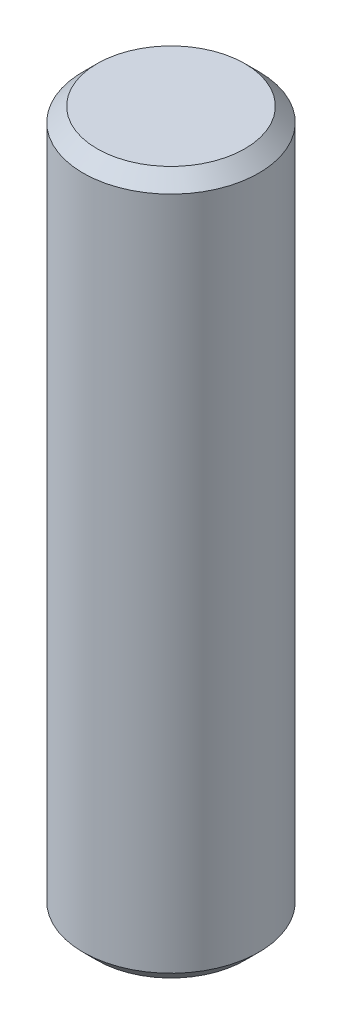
ISO-10303-21;
HEADER;
FILE_DESCRIPTION(('STEP AP214'),'2;1');
FILE_NAME('part.step','',(''),(''),'','','');
FILE_SCHEMA(('AUTOMOTIVE_DESIGN { 1 0 10303 214 1 1 1 1 }'));
ENDSEC;
DATA;
#1=APPLICATION_CONTEXT('core data for automotive mechanical design processes');
#2=APPLICATION_PROTOCOL_DEFINITION('international standard','automotive_design',2000,#1);
#3=PRODUCT_CONTEXT('',#1,'mechanical');
#4=PRODUCT('Part','Part','',(#3));
#5=PRODUCT_RELATED_PRODUCT_CATEGORY('part','',(#4));
#6=PRODUCT_DEFINITION_FORMATION('','',#4);
#7=PRODUCT_DEFINITION_CONTEXT('part definition',#1,'design');
#8=PRODUCT_DEFINITION('design','',#6,#7);
#9=PRODUCT_DEFINITION_SHAPE('','',#8);
#10=(LENGTH_UNIT() NAMED_UNIT(*) SI_UNIT(.MILLI.,.METRE.));
#11=(NAMED_UNIT(*) PLANE_ANGLE_UNIT() SI_UNIT($,.RADIAN.));
#12=(NAMED_UNIT(*) SI_UNIT($,.STERADIAN.) SOLID_ANGLE_UNIT());
#13=UNCERTAINTY_MEASURE_WITH_UNIT(LENGTH_MEASURE(1.E-05),#10,'distance_accuracy_value','');
#14=(GEOMETRIC_REPRESENTATION_CONTEXT(3) GLOBAL_UNCERTAINTY_ASSIGNED_CONTEXT((#13)) GLOBAL_UNIT_ASSIGNED_CONTEXT((#10,
#11,#12)) REPRESENTATION_CONTEXT('',''));
#15=CARTESIAN_POINT('',(0.,0.,0.));
#16=DIRECTION('',(0.,0.,1.));
#17=DIRECTION('',(1.,0.,0.));
#18=AXIS2_PLACEMENT_3D('',#15,#16,#17);
#19=CARTESIAN_POINT('',(0.,38.1,0.));
#20=DIRECTION('',(0.,-1.,0.));
#21=DIRECTION('',(0.,0.,-1.));
#22=AXIS2_PLACEMENT_3D('',#19,#20,#21);
#23=CYLINDRICAL_SURFACE('',#22,9.52754);
#24=CARTESIAN_POINT('',(0.,-36.5759999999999,0.));
#25=DIRECTION('',(0.,1.,0.));
#26=DIRECTION('',(0.,0.,1.));
#27=AXIS2_PLACEMENT_3D('',#24,#25,#26);
#28=CIRCLE('',#27,9.52754);
#29=CARTESIAN_POINT('',(0.,-36.576,-9.52754));
#30=VERTEX_POINT('',#29);
#31=EDGE_CURVE('E40',#30,#30,#28,.T.);
#32=CARTESIAN_POINT('',(0.,36.576,0.));
#33=DIRECTION('',(0.,1.,0.));
#34=DIRECTION('',(0.,0.,1.));
#35=AXIS2_PLACEMENT_3D('',#32,#33,#34);
#36=CIRCLE('',#35,9.52754);
#37=CARTESIAN_POINT('',(0.,36.576,-9.52754));
#38=VERTEX_POINT('',#37);
#39=EDGE_CURVE('E44',#38,#38,#36,.F.);
#40=CARTESIAN_POINT('',(0.,-36.576,-9.52754));
#41=CARTESIAN_POINT('',(0.,-35.814,-9.52754));
#42=CARTESIAN_POINT('',(0.,-35.0519999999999,-9.52754));
#43=CARTESIAN_POINT('',(0.,-33.528,-9.52754));
#44=CARTESIAN_POINT('',(0.,-32.766,-9.52754));
#45=CARTESIAN_POINT('',(0.,-31.242,-9.52754));
#46=CARTESIAN_POINT('',(0.,-30.4799999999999,-9.52754));
#47=CARTESIAN_POINT('',(0.,-28.9559999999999,-9.52754));
#48=CARTESIAN_POINT('',(0.,-28.1939999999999,-9.52754));
#49=CARTESIAN_POINT('',(0.,-26.67,-9.52754));
#50=CARTESIAN_POINT('',(0.,-25.908,-9.52754));
#51=CARTESIAN_POINT('',(0.,-24.384,-9.52754));
#52=CARTESIAN_POINT('',(0.,-23.622,-9.52754));
#53=CARTESIAN_POINT('',(0.,-22.098,-9.52754));
#54=CARTESIAN_POINT('',(0.,-21.336,-9.52754));
#55=CARTESIAN_POINT('',(0.,-19.812,-9.52754));
#56=CARTESIAN_POINT('',(0.,-19.05,-9.52754));
#57=CARTESIAN_POINT('',(0.,-17.526,-9.52754));
#58=CARTESIAN_POINT('',(0.,-16.764,-9.52754));
#59=CARTESIAN_POINT('',(0.,-15.24,-9.52754));
#60=CARTESIAN_POINT('',(0.,-14.478,-9.52754));
#61=CARTESIAN_POINT('',(0.,-12.954,-9.52754));
#62=CARTESIAN_POINT('',(0.,-12.192,-9.52754));
#63=CARTESIAN_POINT('',(0.,-10.668,-9.52754));
#64=CARTESIAN_POINT('',(0.,-9.90599999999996,-9.52754));
#65=CARTESIAN_POINT('',(0.,-8.38199999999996,-9.52754));
#66=CARTESIAN_POINT('',(0.,-7.61999999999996,-9.52754));
#67=CARTESIAN_POINT('',(0.,-6.09599999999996,-9.52754));
#68=CARTESIAN_POINT('',(0.,-5.33399999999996,-9.52754));
#69=CARTESIAN_POINT('',(0.,-3.80999999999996,-9.52754));
#70=CARTESIAN_POINT('',(0.,-3.04799999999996,-9.52754));
#71=CARTESIAN_POINT('',(0.,-1.52399999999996,-9.52754));
#72=CARTESIAN_POINT('',(0.,-0.761999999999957,-9.52754));
#73=CARTESIAN_POINT('',(0.,0.76200000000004,-9.52754));
#74=CARTESIAN_POINT('',(0.,1.52400000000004,-9.52754));
#75=CARTESIAN_POINT('',(0.,3.04800000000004,-9.52754));
#76=CARTESIAN_POINT('',(0.,3.81000000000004,-9.52754));
#77=CARTESIAN_POINT('',(0.,5.33400000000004,-9.52754));
#78=CARTESIAN_POINT('',(0.,6.09600000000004,-9.52754));
#79=CARTESIAN_POINT('',(0.,7.62000000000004,-9.52754));
#80=CARTESIAN_POINT('',(0.,8.38200000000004,-9.52754));
#81=CARTESIAN_POINT('',(0.,9.90600000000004,-9.52754));
#82=CARTESIAN_POINT('',(0.,10.668,-9.52754));
#83=CARTESIAN_POINT('',(0.,12.192,-9.52754));
#84=CARTESIAN_POINT('',(0.,12.954,-9.52754));
#85=CARTESIAN_POINT('',(0.,14.478,-9.52754));
#86=CARTESIAN_POINT('',(0.,15.24,-9.52754));
#87=CARTESIAN_POINT('',(0.,16.764,-9.52754));
#88=CARTESIAN_POINT('',(0.,17.526,-9.52754));
#89=CARTESIAN_POINT('',(0.,19.05,-9.52754));
#90=CARTESIAN_POINT('',(0.,19.812,-9.52754));
#91=CARTESIAN_POINT('',(0.,21.336,-9.52754));
#92=CARTESIAN_POINT('',(0.,22.098,-9.52754));
#93=CARTESIAN_POINT('',(0.,23.622,-9.52754));
#94=CARTESIAN_POINT('',(0.,24.384,-9.52754));
#95=CARTESIAN_POINT('',(0.,25.908,-9.52754));
#96=CARTESIAN_POINT('',(0.,26.67,-9.52754));
#97=CARTESIAN_POINT('',(0.,28.194,-9.52754));
#98=CARTESIAN_POINT('',(0.,28.956,-9.52754));
#99=CARTESIAN_POINT('',(0.,30.48,-9.52754));
#100=CARTESIAN_POINT('',(0.,31.242,-9.52754));
#101=CARTESIAN_POINT('',(0.,32.766,-9.52754));
#102=CARTESIAN_POINT('',(0.,33.528,-9.52754));
#103=CARTESIAN_POINT('',(0.,35.052,-9.52754));
#104=CARTESIAN_POINT('',(0.,35.814,-9.52754));
#105=CARTESIAN_POINT('',(0.,36.576,-9.52754));
#106=B_SPLINE_CURVE_WITH_KNOTS('',3,(#40,#41,#42,#43,#44,#45,#46,#47,#48,#49,#50,#51,#52,#53,
#54,#55,#56,#57,#58,#59,#60,#61,#62,#63,#64,#65,#66,#67,#68,#69,#70,#71,#72,#73,#74,#75,#76,#77,
#78,#79,#80,#81,#82,#83,#84,#85,#86,#87,#88,#89,#90,#91,#92,#93,#94,#95,#96,#97,#98,#99,#100,
#101,#102,#103,#104,#105),.UNSPECIFIED.,.F.,.F.,(4,2,2,2,2,2,2,2,2,2,2,2,2,2,2,2,2,2,2,2,2,2,2,
2,2,2,2,2,2,2,2,2,4),(0.,2.286,4.57199999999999,6.858,9.144,11.43,13.716,16.002,18.288,20.574,
22.86,25.146,27.432,29.718,32.004,34.29,36.576,38.862,41.148,43.434,45.72,48.006,50.292,52.578,
54.864,57.15,59.436,61.722,64.008,66.294,68.58,70.866,73.152),.UNSPECIFIED.);
#107=EDGE_CURVE('BSEAM29',#30,#38,#106,.T.);
#108=ORIENTED_EDGE('',*,*,#31,.T.);
#109=ORIENTED_EDGE('',*,*,#39,.T.);
#110=ORIENTED_EDGE('',*,*,#107,.T.);
#111=ORIENTED_EDGE('',*,*,#107,.F.);
#112=EDGE_LOOP('',(#108,#110,#109,#111));
#113=FACE_BOUND('',#112,.T.);
#114=ADVANCED_FACE('F29',(#113),#23,.T.);
#115=CARTESIAN_POINT('',(0.,38.1,0.));
#116=DIRECTION('',(0.,1.,0.));
#117=DIRECTION('',(0.,0.,1.));
#118=AXIS2_PLACEMENT_3D('',#115,#116,#117);
#119=PLANE('',#118);
#120=CARTESIAN_POINT('',(0.,38.1,0.));
#121=DIRECTION('',(0.,1.,0.));
#122=DIRECTION('',(0.,0.,1.));
#123=AXIS2_PLACEMENT_3D('',#120,#121,#122);
#124=CIRCLE('',#123,8.00354000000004);
#125=CARTESIAN_POINT('',(0.,38.1,8.00354000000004));
#126=VERTEX_POINT('',#125);
#127=EDGE_CURVE('E10',#126,#126,#124,.T.);
#128=ORIENTED_EDGE('',*,*,#127,.T.);
#129=EDGE_LOOP('',(#128));
#130=FACE_BOUND('',#129,.T.);
#131=ADVANCED_FACE('F60',(#130),#119,.T.);
#132=CARTESIAN_POINT('',(0.,-38.1,0.));
#133=DIRECTION('',(0.,1.,0.));
#134=DIRECTION('',(0.,0.,1.));
#135=AXIS2_PLACEMENT_3D('',#132,#133,#134);
#136=PLANE('',#135);
#137=CARTESIAN_POINT('',(0.,-38.1,0.));
#138=DIRECTION('',(0.,1.,0.));
#139=DIRECTION('',(0.,0.,1.));
#140=AXIS2_PLACEMENT_3D('',#137,#138,#139);
#141=CIRCLE('',#140,8.00353999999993);
#142=CARTESIAN_POINT('',(0.,-38.1,8.00353999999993));
#143=VERTEX_POINT('',#142);
#144=EDGE_CURVE('E36',#143,#143,#141,.F.);
#145=ORIENTED_EDGE('',*,*,#144,.T.);
#146=EDGE_LOOP('',(#145));
#147=FACE_BOUND('',#146,.T.);
#148=ADVANCED_FACE('F57',(#147),#136,.F.);
#149=CARTESIAN_POINT('',(0.,-36.5759999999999,0.));
#150=DIRECTION('',(0.,1.,0.));
#151=DIRECTION('',(0.,0.,1.));
#152=AXIS2_PLACEMENT_3D('',#149,#150,#151);
#153=CONICAL_SURFACE('',#152,9.52754,0.785398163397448);
#154=ORIENTED_EDGE('',*,*,#144,.F.);
#155=EDGE_LOOP('',(#154));
#156=FACE_BOUND('',#155,.T.);
#157=ORIENTED_EDGE('',*,*,#31,.F.);
#158=EDGE_LOOP('',(#157));
#159=FACE_BOUND('',#158,.T.);
#160=ADVANCED_FACE('F53',(#156,#159),#153,.T.);
#161=CARTESIAN_POINT('',(0.,38.1,0.));
#162=DIRECTION('',(0.,-1.,0.));
#163=DIRECTION('',(0.,0.,-1.));
#164=AXIS2_PLACEMENT_3D('',#161,#162,#163);
#165=CONICAL_SURFACE('',#164,8.00354000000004,0.785398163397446);
#166=ORIENTED_EDGE('',*,*,#39,.F.);
#167=EDGE_LOOP('',(#166));
#168=FACE_BOUND('',#167,.T.);
#169=ORIENTED_EDGE('',*,*,#127,.F.);
#170=EDGE_LOOP('',(#169));
#171=FACE_BOUND('',#170,.T.);
#172=ADVANCED_FACE('F31',(#168,#171),#165,.T.);
#173=CLOSED_SHELL('',(#114,#131,#148,#160,#172));
#174=MANIFOLD_SOLID_BREP('B2',#173);
#175=ADVANCED_BREP_SHAPE_REPRESENTATION('',(#18,#174),#14);
#176=SHAPE_DEFINITION_REPRESENTATION(#9,#175);
ENDSEC;
END-ISO-10303-21;
